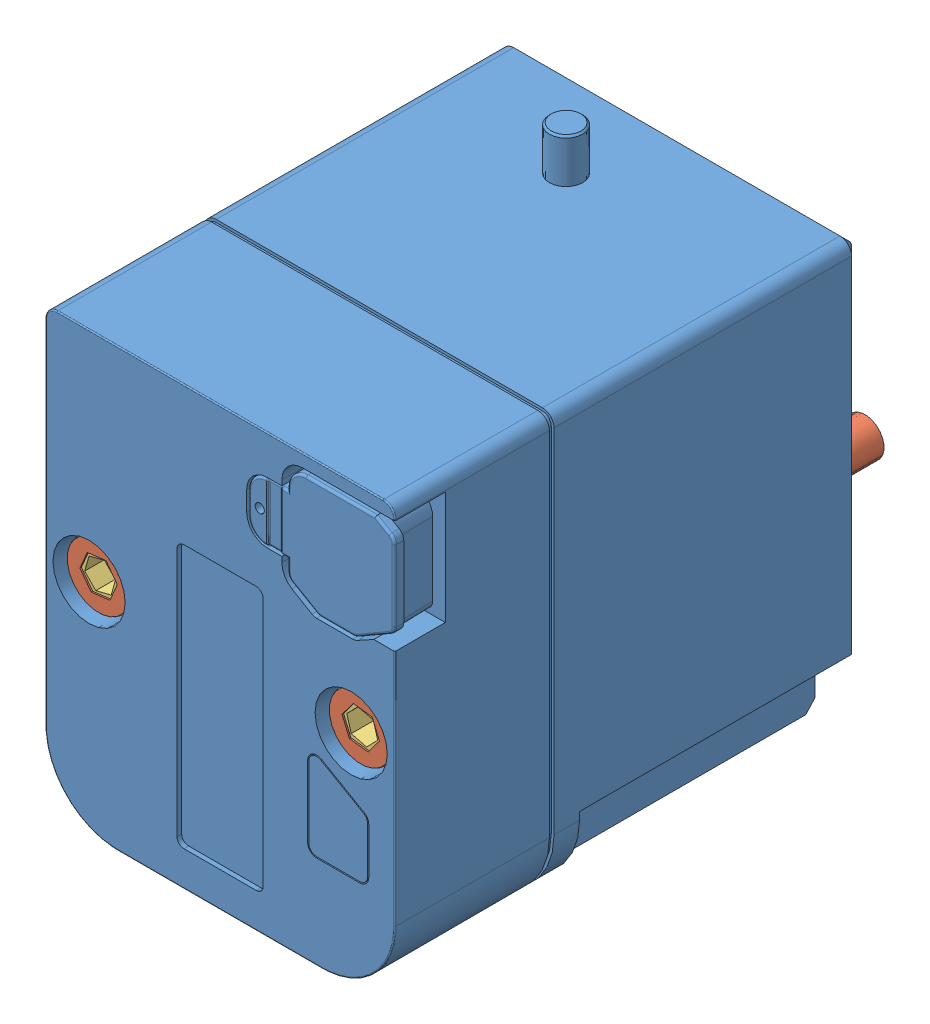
SolidWorks assembly CVE-RT.SLDASM, configuration Default (file format 13000). Lengths in mm.
Overall size (38.47 52.4 56.01).
5 component instances, 3 part files, 2 mates.
Components (placement in the parent):
- CVE-RT-1: CVE-RT.sldprt [Default] at origin size (38.1 52.4 50.81)
- SHCS8-32L2.00-1: SHCS8-32L2.00.sldprt [SHCS8-32L2.00] at (14.2875 -23.7998 -5.207) x (-0.118995 -0.992895 0) z (0 0 -1) size (6.86 6.86 54.97)
- SHCSM4-.7L50-1: SHCSM4-.7L50.sldprt [SHCSM4-.7L50] at (-14.2875 -23.7998 -5.207) x (-0.718188 -0.695849 0) z (0 0 -1) size (7 7 54)
- SHCS8-32L2.00-2: SHCS8-32L2.00.sldprt [SHCS8-32L2.00] at (-14.2875 -23.7998 -5.207) x (-0.118995 0.992895 0) z (0 0 -1) size (6.86 6.86 54.97)
- SHCSM4-.7L50-2: SHCSM4-.7L50.sldprt [SHCSM4-.7L50] at (14.2875 -23.7998 -5.207) x (-0.718188 0.695849 0) z (0 0 -1) size (7 7 54)
Mates (geometry in assembly coordinates):
- ProfileCenter1: profile center anti-aligned: plane of CVE-RT-1 through (-18.2245 -23.7998 -5.207) normal (0 0 1); circle of SHCSM4-.7L50-1
- ProfileCenter3: profile center anti-aligned: plane of CVE-RT-1 through (18.2245 -23.7998 -5.207) normal (0 0 1); circle of SHCS8-32L2.00-1
